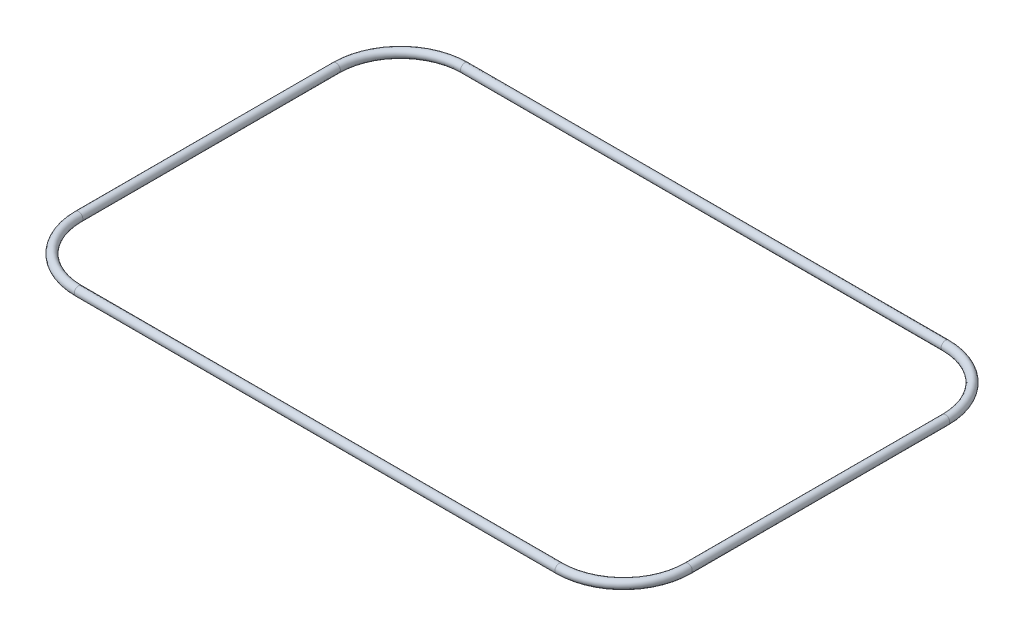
from build123d import *

# Parameters (mm, degrees)
SWEEP1_PROFILE_R = 0.79375


with BuildPart() as part:
    # Sweep1: sweep along a path in Sketch1
    with BuildLine(Plane(origin=(0, 0, 0), x_dir=(1, 0, 0), z_dir=(0, 1, 0))) as sweep1_path:
        Line((-44.44875, -35.72), (44.44875, -35.72))
        ThreePointArc((44.44875, -35.72), (52.867740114, -32.232740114), (56.355, -23.81375))
        Line((56.355, -23.81375), (56.355, 23.81375))
        ThreePointArc((56.355, 23.81375), (52.867740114, 32.232740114), (44.44875, 35.72))
        Line((44.44875, 35.72), (-44.44875, 35.72))
        ThreePointArc((-44.44875, 35.72), (-52.867740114, 32.232740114), (-56.355, 23.81375))
        Line((-56.355, 23.81375), (-56.355, -23.81375))
        ThreePointArc((-56.355, -23.81375), (-52.867740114, -32.232740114), (-44.44875, -35.72))
    # Sweep1 profile (on start of the path) → Sweep1 (sweep)
    with BuildSketch(Plane(origin=(-44.44875, 0, 35.72), x_dir=(0, 0, 1), z_dir=(1, 0, 0))):
        Circle(SWEEP1_PROFILE_R)
    sweep(path=sweep1_path.line)


solid = part.part
